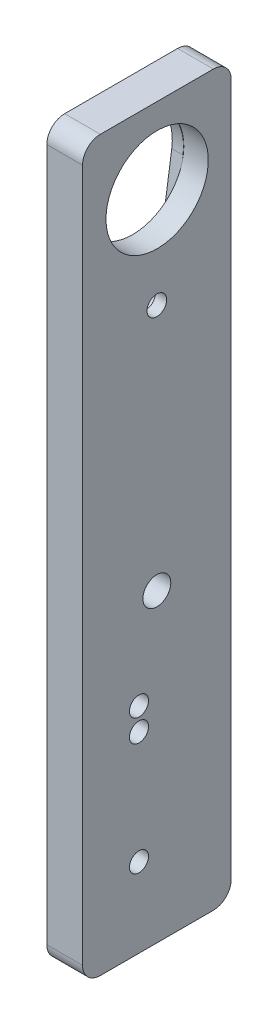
ISO-10303-21;
HEADER;
FILE_DESCRIPTION(('STEP AP214'),'2;1');
FILE_NAME('part.step','',(''),(''),'','','');
FILE_SCHEMA(('AUTOMOTIVE_DESIGN { 1 0 10303 214 1 1 1 1 }'));
ENDSEC;
DATA;
#1=APPLICATION_CONTEXT('core data for automotive mechanical design processes');
#2=APPLICATION_PROTOCOL_DEFINITION('international standard','automotive_design',2000,#1);
#3=PRODUCT_CONTEXT('',#1,'mechanical');
#4=PRODUCT('Part','Part','',(#3));
#5=PRODUCT_RELATED_PRODUCT_CATEGORY('part','',(#4));
#6=PRODUCT_DEFINITION_FORMATION('','',#4);
#7=PRODUCT_DEFINITION_CONTEXT('part definition',#1,'design');
#8=PRODUCT_DEFINITION('design','',#6,#7);
#9=PRODUCT_DEFINITION_SHAPE('','',#8);
#10=(LENGTH_UNIT() NAMED_UNIT(*) SI_UNIT(.MILLI.,.METRE.));
#11=(NAMED_UNIT(*) PLANE_ANGLE_UNIT() SI_UNIT($,.RADIAN.));
#12=(NAMED_UNIT(*) SI_UNIT($,.STERADIAN.) SOLID_ANGLE_UNIT());
#13=UNCERTAINTY_MEASURE_WITH_UNIT(LENGTH_MEASURE(1.E-05),#10,'distance_accuracy_value','');
#14=(GEOMETRIC_REPRESENTATION_CONTEXT(3) GLOBAL_UNCERTAINTY_ASSIGNED_CONTEXT((#13)) GLOBAL_UNIT_ASSIGNED_CONTEXT((#10,
#11,#12)) REPRESENTATION_CONTEXT('',''));
#15=CARTESIAN_POINT('',(0.,0.,0.));
#16=DIRECTION('',(0.,0.,1.));
#17=DIRECTION('',(1.,0.,0.));
#18=AXIS2_PLACEMENT_3D('',#15,#16,#17);
#19=CARTESIAN_POINT('',(-39.6009605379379,30.3127212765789,1.62352832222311));
#20=DIRECTION('',(-1.,0.,0.));
#21=DIRECTION('',(0.,0.,1.));
#22=AXIS2_PLACEMENT_3D('',#19,#20,#21);
#23=CYLINDRICAL_SURFACE('',#22,4.);
#24=CARTESIAN_POINT('',(-43.9509605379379,30.3127212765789,1.62352832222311));
#25=DIRECTION('',(-1.,0.,0.));
#26=DIRECTION('',(0.,0.,1.));
#27=AXIS2_PLACEMENT_3D('',#24,#25,#26);
#28=CIRCLE('',#27,4.);
#29=CARTESIAN_POINT('',(-43.9509605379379,30.3127212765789,5.62352832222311));
#30=VERTEX_POINT('',#29);
#31=EDGE_CURVE('E168',#30,#30,#28,.T.);
#32=ORIENTED_EDGE('',*,*,#31,.T.);
#33=EDGE_LOOP('',(#32));
#34=FACE_BOUND('',#33,.T.);
#35=CARTESIAN_POINT('',(-41.6009605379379,30.3127212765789,1.62352832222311));
#36=DIRECTION('',(1.,0.,0.));
#37=DIRECTION('',(0.,0.,-1.));
#38=AXIS2_PLACEMENT_3D('',#35,#36,#37);
#39=CIRCLE('',#38,4.);
#40=CARTESIAN_POINT('',(-41.6009605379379,30.3127212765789,-2.3764716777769));
#41=VERTEX_POINT('',#40);
#42=EDGE_CURVE('E11',#41,#41,#39,.F.);
#43=ORIENTED_EDGE('',*,*,#42,.F.);
#44=EDGE_LOOP('',(#43));
#45=FACE_BOUND('',#44,.T.);
#46=ADVANCED_FACE('F39',(#34,#45),#23,.F.);
#47=CARTESIAN_POINT('',(-39.6009605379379,-67.9224024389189,4.79852832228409));
#48=DIRECTION('',(0.,-1.,0.));
#49=DIRECTION('',(0.,0.,-1.));
#50=AXIS2_PLACEMENT_3D('',#47,#48,#49);
#51=PLANE('',#50);
#52=DIRECTION('',(0.,0.,1.));
#53=VECTOR('',#52,1.);
#54=CARTESIAN_POINT('',(-45.9509605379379,-67.9224024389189,4.79852832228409));
#55=LINE('',#54,#53);
#56=CARTESIAN_POINT('',(-45.9509605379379,-67.9224024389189,-8.42647167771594));
#57=VERTEX_POINT('',#56);
#58=CARTESIAN_POINT('',(-45.9509605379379,-67.9224024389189,11.6735283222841));
#59=VERTEX_POINT('',#58);
#60=EDGE_CURVE('E178',#57,#59,#55,.T.);
#61=ORIENTED_EDGE('',*,*,#60,.F.);
#62=DIRECTION('',(-1.,0.,0.));
#63=VECTOR('',#62,1.);
#64=CARTESIAN_POINT('',(-39.6009605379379,-67.9224024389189,-8.42647167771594));
#65=LINE('',#64,#63);
#66=CARTESIAN_POINT('',(-39.6009605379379,-67.9224024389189,-8.42647167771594));
#67=VERTEX_POINT('',#66);
#68=EDGE_CURVE('E236',#57,#67,#65,.F.);
#69=ORIENTED_EDGE('',*,*,#68,.T.);
#70=DIRECTION('',(0.,0.,1.));
#71=VECTOR('',#70,1.);
#72=CARTESIAN_POINT('',(-39.6009605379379,-67.9224024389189,4.79852832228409));
#73=LINE('',#72,#71);
#74=CARTESIAN_POINT('',(-39.6009605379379,-67.9224024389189,11.6735283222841));
#75=VERTEX_POINT('',#74);
#76=EDGE_CURVE('E184',#67,#75,#73,.T.);
#77=ORIENTED_EDGE('',*,*,#76,.T.);
#78=DIRECTION('',(-1.,0.,0.));
#79=VECTOR('',#78,1.);
#80=CARTESIAN_POINT('',(-39.6009605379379,-67.9224024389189,11.6735283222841));
#81=LINE('',#80,#79);
#82=EDGE_CURVE('E233',#75,#59,#81,.T.);
#83=ORIENTED_EDGE('',*,*,#82,.T.);
#84=EDGE_LOOP('',(#61,#69,#77,#83));
#85=FACE_BOUND('',#84,.T.);
#86=ADVANCED_FACE('F310',(#85),#51,.T.);
#87=CARTESIAN_POINT('',(-39.6009605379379,28.6275975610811,-11.6014716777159));
#88=DIRECTION('',(0.,0.,-1.));
#89=DIRECTION('',(0.,1.,0.));
#90=AXIS2_PLACEMENT_3D('',#87,#88,#89);
#91=PLANE('',#90);
#92=DIRECTION('',(0.,-1.,0.));
#93=VECTOR('',#92,1.);
#94=CARTESIAN_POINT('',(-45.9509605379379,28.6275975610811,-11.6014716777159));
#95=LINE('',#94,#93);
#96=CARTESIAN_POINT('',(-45.9509605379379,58.5025975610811,-11.6014716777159));
#97=VERTEX_POINT('',#96);
#98=CARTESIAN_POINT('',(-45.9509605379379,-64.7474024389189,-11.6014716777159));
#99=VERTEX_POINT('',#98);
#100=EDGE_CURVE('E199',#97,#99,#95,.T.);
#101=ORIENTED_EDGE('',*,*,#100,.F.);
#102=DIRECTION('',(-1.,0.,0.));
#103=VECTOR('',#102,1.);
#104=CARTESIAN_POINT('',(-39.6009605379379,58.5025975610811,-11.6014716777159));
#105=LINE('',#104,#103);
#106=CARTESIAN_POINT('',(-39.6009605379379,58.5025975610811,-11.6014716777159));
#107=VERTEX_POINT('',#106);
#108=EDGE_CURVE('E222',#97,#107,#105,.F.);
#109=ORIENTED_EDGE('',*,*,#108,.T.);
#110=DIRECTION('',(0.,-1.,0.));
#111=VECTOR('',#110,1.);
#112=CARTESIAN_POINT('',(-39.6009605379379,28.6275975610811,-11.6014716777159));
#113=LINE('',#112,#111);
#114=CARTESIAN_POINT('',(-39.6009605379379,-64.7474024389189,-11.6014716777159));
#115=VERTEX_POINT('',#114);
#116=EDGE_CURVE('E187',#107,#115,#113,.T.);
#117=ORIENTED_EDGE('',*,*,#116,.T.);
#118=DIRECTION('',(-1.,0.,0.));
#119=VECTOR('',#118,1.);
#120=CARTESIAN_POINT('',(-39.6009605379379,-64.7474024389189,-11.6014716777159));
#121=LINE('',#120,#119);
#122=EDGE_CURVE('E219',#115,#99,#121,.T.);
#123=ORIENTED_EDGE('',*,*,#122,.T.);
#124=EDGE_LOOP('',(#101,#109,#117,#123));
#125=FACE_BOUND('',#124,.T.);
#126=ADVANCED_FACE('F316',(#125),#91,.T.);
#127=CARTESIAN_POINT('',(-39.6009605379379,61.6775975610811,4.79852832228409));
#128=DIRECTION('',(0.,1.,0.));
#129=DIRECTION('',(0.,0.,1.));
#130=AXIS2_PLACEMENT_3D('',#127,#128,#129);
#131=PLANE('',#130);
#132=DIRECTION('',(0.,0.,-1.));
#133=VECTOR('',#132,1.);
#134=CARTESIAN_POINT('',(-39.6009605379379,61.6775975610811,4.79852832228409));
#135=LINE('',#134,#133);
#136=CARTESIAN_POINT('',(-39.6009605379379,61.6775975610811,11.6735283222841));
#137=VERTEX_POINT('',#136);
#138=CARTESIAN_POINT('',(-39.6009605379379,61.6775975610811,-8.42647167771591));
#139=VERTEX_POINT('',#138);
#140=EDGE_CURVE('E191',#137,#139,#135,.T.);
#141=ORIENTED_EDGE('',*,*,#140,.T.);
#142=DIRECTION('',(-1.,0.,0.));
#143=VECTOR('',#142,1.);
#144=CARTESIAN_POINT('',(-39.6009605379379,61.6775975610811,-8.42647167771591));
#145=LINE('',#144,#143);
#146=CARTESIAN_POINT('',(-45.9509605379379,61.6775975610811,-8.42647167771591));
#147=VERTEX_POINT('',#146);
#148=EDGE_CURVE('E207',#139,#147,#145,.T.);
#149=ORIENTED_EDGE('',*,*,#148,.T.);
#150=DIRECTION('',(0.,0.,-1.));
#151=VECTOR('',#150,1.);
#152=CARTESIAN_POINT('',(-45.9509605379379,61.6775975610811,4.79852832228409));
#153=LINE('',#152,#151);
#154=CARTESIAN_POINT('',(-45.9509605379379,61.6775975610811,11.6735283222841));
#155=VERTEX_POINT('',#154);
#156=EDGE_CURVE('E202',#155,#147,#153,.T.);
#157=ORIENTED_EDGE('',*,*,#156,.F.);
#158=DIRECTION('',(-1.,0.,0.));
#159=VECTOR('',#158,1.);
#160=CARTESIAN_POINT('',(-39.6009605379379,61.6775975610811,11.6735283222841));
#161=LINE('',#160,#159);
#162=EDGE_CURVE('E196',#155,#137,#161,.F.);
#163=ORIENTED_EDGE('',*,*,#162,.T.);
#164=EDGE_LOOP('',(#141,#149,#157,#163));
#165=FACE_BOUND('',#164,.T.);
#166=ADVANCED_FACE('F304',(#165),#131,.T.);
#167=CARTESIAN_POINT('',(-39.6009605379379,28.6275975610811,14.8485283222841));
#168=DIRECTION('',(0.,0.,1.));
#169=DIRECTION('',(0.,-1.,0.));
#170=AXIS2_PLACEMENT_3D('',#167,#168,#169);
#171=PLANE('',#170);
#172=DIRECTION('',(0.,1.,0.));
#173=VECTOR('',#172,1.);
#174=CARTESIAN_POINT('',(-39.6009605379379,28.6275975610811,14.8485283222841));
#175=LINE('',#174,#173);
#176=CARTESIAN_POINT('',(-39.6009605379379,-64.7474024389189,14.8485283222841));
#177=VERTEX_POINT('',#176);
#178=CARTESIAN_POINT('',(-39.6009605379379,58.5025975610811,14.8485283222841));
#179=VERTEX_POINT('',#178);
#180=EDGE_CURVE('E194',#177,#179,#175,.T.);
#181=ORIENTED_EDGE('',*,*,#180,.T.);
#182=DIRECTION('',(-1.,0.,0.));
#183=VECTOR('',#182,1.);
#184=CARTESIAN_POINT('',(-39.6009605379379,58.5025975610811,14.8485283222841));
#185=LINE('',#184,#183);
#186=CARTESIAN_POINT('',(-45.9509605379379,58.5025975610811,14.8485283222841));
#187=VERTEX_POINT('',#186);
#188=EDGE_CURVE('E137',#179,#187,#185,.T.);
#189=ORIENTED_EDGE('',*,*,#188,.T.);
#190=DIRECTION('',(0.,1.,0.));
#191=VECTOR('',#190,1.);
#192=CARTESIAN_POINT('',(-45.9509605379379,28.6275975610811,14.8485283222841));
#193=LINE('',#192,#191);
#194=CARTESIAN_POINT('',(-45.9509605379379,-64.7474024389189,14.8485283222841));
#195=VERTEX_POINT('',#194);
#196=EDGE_CURVE('E188',#195,#187,#193,.T.);
#197=ORIENTED_EDGE('',*,*,#196,.F.);
#198=DIRECTION('',(-1.,0.,0.));
#199=VECTOR('',#198,1.);
#200=CARTESIAN_POINT('',(-39.6009605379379,-64.7474024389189,14.8485283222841));
#201=LINE('',#200,#199);
#202=EDGE_CURVE('E238',#195,#177,#201,.F.);
#203=ORIENTED_EDGE('',*,*,#202,.T.);
#204=EDGE_LOOP('',(#181,#189,#197,#203));
#205=FACE_BOUND('',#204,.T.);
#206=ADVANCED_FACE('F292',(#205),#171,.T.);
#207=CARTESIAN_POINT('',(-39.6009605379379,28.6275975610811,4.79852832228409));
#208=DIRECTION('',(1.,0.,0.));
#209=DIRECTION('',(0.,0.,-1.));
#210=AXIS2_PLACEMENT_3D('',#207,#208,#209);
#211=PLANE('',#210);
#212=CARTESIAN_POINT('',(-39.6009605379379,-29.8224024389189,4.79852832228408));
#213=DIRECTION('',(-1.,0.,0.));
#214=DIRECTION('',(0.,0.,1.));
#215=AXIS2_PLACEMENT_3D('',#212,#213,#214);
#216=CIRCLE('',#215,1.7);
#217=CARTESIAN_POINT('',(-39.6009605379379,-29.8224024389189,6.49852832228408));
#218=VERTEX_POINT('',#217);
#219=EDGE_CURVE('E255',#218,#218,#216,.T.);
#220=ORIENTED_EDGE('',*,*,#219,.T.);
#221=EDGE_LOOP('',(#220));
#222=FACE_BOUND('',#221,.T.);
#223=CARTESIAN_POINT('',(-39.6009605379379,-33.8224024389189,4.79852832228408));
#224=DIRECTION('',(-1.,0.,0.));
#225=DIRECTION('',(0.,0.,1.));
#226=AXIS2_PLACEMENT_3D('',#223,#224,#225);
#227=CIRCLE('',#226,1.7);
#228=CARTESIAN_POINT('',(-39.6009605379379,-33.8224024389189,6.49852832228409));
#229=VERTEX_POINT('',#228);
#230=EDGE_CURVE('E263',#229,#229,#227,.T.);
#231=ORIENTED_EDGE('',*,*,#230,.T.);
#232=EDGE_LOOP('',(#231));
#233=FACE_BOUND('',#232,.T.);
#234=CARTESIAN_POINT('',(-39.6009605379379,-53.8224024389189,4.79852832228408));
#235=DIRECTION('',(-1.,0.,0.));
#236=DIRECTION('',(0.,0.,1.));
#237=AXIS2_PLACEMENT_3D('',#234,#235,#236);
#238=CIRCLE('',#237,1.7);
#239=CARTESIAN_POINT('',(-39.6009605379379,-53.8224024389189,6.49852832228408));
#240=VERTEX_POINT('',#239);
#241=EDGE_CURVE('E256',#240,#240,#238,.T.);
#242=ORIENTED_EDGE('',*,*,#241,.T.);
#243=EDGE_LOOP('',(#242));
#244=FACE_BOUND('',#243,.T.);
#245=CARTESIAN_POINT('',(-39.6009605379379,-13.6600363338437,1.62352832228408));
#246=DIRECTION('',(1.,0.,0.));
#247=DIRECTION('',(0.,0.,-1.));
#248=AXIS2_PLACEMENT_3D('',#245,#246,#247);
#249=CIRCLE('',#248,2.48125);
#250=CARTESIAN_POINT('',(-39.6009605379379,-13.6600363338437,-0.857721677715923));
#251=VERTEX_POINT('',#250);
#252=EDGE_CURVE('E145',#251,#251,#249,.T.);
#253=ORIENTED_EDGE('',*,*,#252,.F.);
#254=EDGE_LOOP('',(#253));
#255=FACE_BOUND('',#254,.T.);
#256=CARTESIAN_POINT('',(-39.6009605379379,48.096086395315,1.57324528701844));
#257=DIRECTION('',(-1.,0.,0.));
#258=DIRECTION('',(0.,0.,1.));
#259=AXIS2_PLACEMENT_3D('',#256,#257,#258);
#260=CIRCLE('',#259,9.1);
#261=CARTESIAN_POINT('',(-39.6009605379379,48.096086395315,10.6732452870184));
#262=VERTEX_POINT('',#261);
#263=EDGE_CURVE('E144',#262,#262,#260,.T.);
#264=ORIENTED_EDGE('',*,*,#263,.T.);
#265=EDGE_LOOP('',(#264));
#266=FACE_BOUND('',#265,.T.);
#267=ORIENTED_EDGE('',*,*,#180,.F.);
#268=CARTESIAN_POINT('',(-39.6009605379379,-64.7474024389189,11.6735283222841));
#269=DIRECTION('',(1.,0.,0.));
#270=DIRECTION('',(0.,0.,-1.));
#271=AXIS2_PLACEMENT_3D('',#268,#269,#270);
#272=CIRCLE('',#271,3.175);
#273=EDGE_CURVE('E227',#177,#75,#272,.T.);
#274=ORIENTED_EDGE('',*,*,#273,.T.);
#275=ORIENTED_EDGE('',*,*,#76,.F.);
#276=CARTESIAN_POINT('',(-39.6009605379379,-64.7474024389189,-8.42647167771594));
#277=DIRECTION('',(1.,0.,0.));
#278=DIRECTION('',(0.,0.,-1.));
#279=AXIS2_PLACEMENT_3D('',#276,#277,#278);
#280=CIRCLE('',#279,3.175);
#281=EDGE_CURVE('E229',#67,#115,#280,.T.);
#282=ORIENTED_EDGE('',*,*,#281,.T.);
#283=ORIENTED_EDGE('',*,*,#116,.F.);
#284=CARTESIAN_POINT('',(-39.6009605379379,58.5025975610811,-8.42647167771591));
#285=DIRECTION('',(1.,0.,0.));
#286=DIRECTION('',(0.,0.,-1.));
#287=AXIS2_PLACEMENT_3D('',#284,#285,#286);
#288=CIRCLE('',#287,3.175);
#289=EDGE_CURVE('E231',#107,#139,#288,.T.);
#290=ORIENTED_EDGE('',*,*,#289,.T.);
#291=ORIENTED_EDGE('',*,*,#140,.F.);
#292=CARTESIAN_POINT('',(-39.6009605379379,58.5025975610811,11.6735283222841));
#293=DIRECTION('',(1.,0.,0.));
#294=DIRECTION('',(0.,0.,-1.));
#295=AXIS2_PLACEMENT_3D('',#292,#293,#294);
#296=CIRCLE('',#295,3.175);
#297=EDGE_CURVE('E224',#137,#179,#296,.T.);
#298=ORIENTED_EDGE('',*,*,#297,.T.);
#299=EDGE_LOOP('',(#267,#274,#275,#282,#283,#290,#291,#298));
#300=FACE_BOUND('',#299,.T.);
#301=CARTESIAN_POINT('',(-39.6009605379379,30.3127212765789,1.62352832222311));
#302=DIRECTION('',(1.,0.,0.));
#303=DIRECTION('',(0.,0.,-1.));
#304=AXIS2_PLACEMENT_3D('',#301,#302,#303);
#305=CIRCLE('',#304,1.75);
#306=CARTESIAN_POINT('',(-39.6009605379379,30.3127212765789,-0.126471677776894));
#307=VERTEX_POINT('',#306);
#308=EDGE_CURVE('E274',#307,#307,#305,.T.);
#309=ORIENTED_EDGE('',*,*,#308,.F.);
#310=EDGE_LOOP('',(#309));
#311=FACE_BOUND('',#310,.T.);
#312=ADVANCED_FACE('F289',(#222,#233,#244,#255,#266,#300,#311),#211,.T.);
#313=CARTESIAN_POINT('',(-45.9509605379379,28.6275975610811,4.79852832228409));
#314=DIRECTION('',(1.,0.,0.));
#315=DIRECTION('',(0.,0.,-1.));
#316=AXIS2_PLACEMENT_3D('',#313,#314,#315);
#317=PLANE('',#316);
#318=CARTESIAN_POINT('',(-45.9509605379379,-29.8224024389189,4.79852832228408));
#319=DIRECTION('',(-1.,0.,0.));
#320=DIRECTION('',(0.,0.,1.));
#321=AXIS2_PLACEMENT_3D('',#318,#319,#320);
#322=CIRCLE('',#321,1.7);
#323=CARTESIAN_POINT('',(-45.9509605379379,-29.8224024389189,6.49852832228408));
#324=VERTEX_POINT('',#323);
#325=EDGE_CURVE('E269',#324,#324,#322,.T.);
#326=ORIENTED_EDGE('',*,*,#325,.F.);
#327=EDGE_LOOP('',(#326));
#328=FACE_BOUND('',#327,.T.);
#329=CARTESIAN_POINT('',(-45.9509605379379,-33.8224024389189,4.79852832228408));
#330=DIRECTION('',(-1.,0.,0.));
#331=DIRECTION('',(0.,0.,1.));
#332=AXIS2_PLACEMENT_3D('',#329,#330,#331);
#333=CIRCLE('',#332,1.7);
#334=CARTESIAN_POINT('',(-45.9509605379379,-33.8224024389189,6.49852832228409));
#335=VERTEX_POINT('',#334);
#336=EDGE_CURVE('E266',#335,#335,#333,.T.);
#337=ORIENTED_EDGE('',*,*,#336,.F.);
#338=EDGE_LOOP('',(#337));
#339=FACE_BOUND('',#338,.T.);
#340=CARTESIAN_POINT('',(-45.9509605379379,-53.8224024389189,4.79852832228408));
#341=DIRECTION('',(-1.,0.,0.));
#342=DIRECTION('',(0.,0.,1.));
#343=AXIS2_PLACEMENT_3D('',#340,#341,#342);
#344=CIRCLE('',#343,1.7);
#345=CARTESIAN_POINT('',(-45.9509605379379,-53.8224024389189,6.49852832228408));
#346=VERTEX_POINT('',#345);
#347=EDGE_CURVE('E259',#346,#346,#344,.T.);
#348=ORIENTED_EDGE('',*,*,#347,.F.);
#349=EDGE_LOOP('',(#348));
#350=FACE_BOUND('',#349,.T.);
#351=CARTESIAN_POINT('',(-45.9509605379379,-13.6600363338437,1.62352832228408));
#352=DIRECTION('',(-1.,0.,0.));
#353=DIRECTION('',(0.,0.,1.));
#354=AXIS2_PLACEMENT_3D('',#351,#352,#353);
#355=CIRCLE('',#354,2.48125);
#356=CARTESIAN_POINT('',(-45.9509605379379,-13.6600363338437,4.10477832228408));
#357=VERTEX_POINT('',#356);
#358=EDGE_CURVE('E252',#357,#357,#355,.T.);
#359=ORIENTED_EDGE('',*,*,#358,.F.);
#360=EDGE_LOOP('',(#359));
#361=FACE_BOUND('',#360,.T.);
#362=DIRECTION('',(0.,-0.989326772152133,0.145713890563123));
#363=VECTOR('',#362,1.);
#364=CARTESIAN_POINT('',(-45.9509605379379,46.7667248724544,-7.37934530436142));
#365=LINE('',#364,#363);
#366=CARTESIAN_POINT('',(-45.9509605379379,46.7667248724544,-7.37934530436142));
#367=VERTEX_POINT('',#366);
#368=CARTESIAN_POINT('',(-45.9509605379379,25.1097350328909,-4.18957592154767));
#369=VERTEX_POINT('',#368);
#370=EDGE_CURVE('E167',#367,#369,#365,.T.);
#371=ORIENTED_EDGE('',*,*,#370,.F.);
#372=CARTESIAN_POINT('',(-45.9509605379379,48.0927212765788,1.62352832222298));
#373=DIRECTION('',(-1.,0.,0.));
#374=DIRECTION('',(0.,0.,1.));
#375=AXIS2_PLACEMENT_3D('',#372,#373,#374);
#376=CIRCLE('',#375,9.1);
#377=CARTESIAN_POINT('',(-45.9509605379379,46.7667248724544,10.6264019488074));
#378=VERTEX_POINT('',#377);
#379=EDGE_CURVE('E61',#378,#367,#376,.T.);
#380=ORIENTED_EDGE('',*,*,#379,.F.);
#381=DIRECTION('',(0.,0.989326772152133,0.145713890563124));
#382=VECTOR('',#381,1.);
#383=CARTESIAN_POINT('',(-45.9509605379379,46.7667248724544,10.6264019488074));
#384=LINE('',#383,#382);
#385=CARTESIAN_POINT('',(-45.9509605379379,25.1097350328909,7.43663256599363));
#386=VERTEX_POINT('',#385);
#387=EDGE_CURVE('E152',#386,#378,#384,.T.);
#388=ORIENTED_EDGE('',*,*,#387,.F.);
#389=DIRECTION('',(0.,0.,1.));
#390=VECTOR('',#389,1.);
#391=CARTESIAN_POINT('',(-45.9509605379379,25.1097350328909,-4.18957592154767));
#392=LINE('',#391,#390);
#393=EDGE_CURVE('E171',#369,#386,#392,.T.);
#394=ORIENTED_EDGE('',*,*,#393,.F.);
#395=EDGE_LOOP('',(#371,#380,#388,#394));
#396=FACE_BOUND('',#395,.T.);
#397=CARTESIAN_POINT('',(-45.9509605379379,-64.7474024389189,11.6735283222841));
#398=DIRECTION('',(1.,0.,0.));
#399=DIRECTION('',(0.,0.,-1.));
#400=AXIS2_PLACEMENT_3D('',#397,#398,#399);
#401=CIRCLE('',#400,3.175);
#402=EDGE_CURVE('E212',#59,#195,#401,.F.);
#403=ORIENTED_EDGE('',*,*,#402,.T.);
#404=ORIENTED_EDGE('',*,*,#196,.T.);
#405=CARTESIAN_POINT('',(-45.9509605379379,58.5025975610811,11.6735283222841));
#406=DIRECTION('',(1.,0.,0.));
#407=DIRECTION('',(0.,0.,-1.));
#408=AXIS2_PLACEMENT_3D('',#405,#406,#407);
#409=CIRCLE('',#408,3.175);
#410=EDGE_CURVE('E210',#187,#155,#409,.F.);
#411=ORIENTED_EDGE('',*,*,#410,.T.);
#412=ORIENTED_EDGE('',*,*,#156,.T.);
#413=CARTESIAN_POINT('',(-45.9509605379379,58.5025975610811,-8.42647167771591));
#414=DIRECTION('',(1.,0.,0.));
#415=DIRECTION('',(0.,0.,-1.));
#416=AXIS2_PLACEMENT_3D('',#413,#414,#415);
#417=CIRCLE('',#416,3.175);
#418=EDGE_CURVE('E217',#147,#97,#417,.F.);
#419=ORIENTED_EDGE('',*,*,#418,.T.);
#420=ORIENTED_EDGE('',*,*,#100,.T.);
#421=CARTESIAN_POINT('',(-45.9509605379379,-64.7474024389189,-8.42647167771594));
#422=DIRECTION('',(1.,0.,0.));
#423=DIRECTION('',(0.,0.,-1.));
#424=AXIS2_PLACEMENT_3D('',#421,#422,#423);
#425=CIRCLE('',#424,3.175);
#426=EDGE_CURVE('E215',#99,#57,#425,.F.);
#427=ORIENTED_EDGE('',*,*,#426,.T.);
#428=ORIENTED_EDGE('',*,*,#60,.T.);
#429=EDGE_LOOP('',(#403,#404,#411,#412,#419,#420,#427,#428));
#430=FACE_BOUND('',#429,.T.);
#431=ADVANCED_FACE('F291',(#328,#339,#350,#361,#396,#430),#317,.F.);
#432=CARTESIAN_POINT('',(-39.6009605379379,58.5025975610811,-8.42647167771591));
#433=DIRECTION('',(-1.,0.,0.));
#434=DIRECTION('',(0.,0.,1.));
#435=AXIS2_PLACEMENT_3D('',#432,#433,#434);
#436=CYLINDRICAL_SURFACE('',#435,3.175);
#437=ORIENTED_EDGE('',*,*,#289,.F.);
#438=ORIENTED_EDGE('',*,*,#108,.F.);
#439=ORIENTED_EDGE('',*,*,#418,.F.);
#440=ORIENTED_EDGE('',*,*,#148,.F.);
#441=EDGE_LOOP('',(#437,#438,#439,#440));
#442=FACE_BOUND('',#441,.T.);
#443=ADVANCED_FACE('F300',(#442),#436,.T.);
#444=CARTESIAN_POINT('',(-39.6009605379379,-64.7474024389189,-8.42647167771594));
#445=DIRECTION('',(-1.,0.,0.));
#446=DIRECTION('',(0.,0.,1.));
#447=AXIS2_PLACEMENT_3D('',#444,#445,#446);
#448=CYLINDRICAL_SURFACE('',#447,3.175);
#449=ORIENTED_EDGE('',*,*,#281,.F.);
#450=ORIENTED_EDGE('',*,*,#68,.F.);
#451=ORIENTED_EDGE('',*,*,#426,.F.);
#452=ORIENTED_EDGE('',*,*,#122,.F.);
#453=EDGE_LOOP('',(#449,#450,#451,#452));
#454=FACE_BOUND('',#453,.T.);
#455=ADVANCED_FACE('F345',(#454),#448,.T.);
#456=CARTESIAN_POINT('',(-39.6009605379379,-64.7474024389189,11.6735283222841));
#457=DIRECTION('',(-1.,0.,0.));
#458=DIRECTION('',(0.,0.,1.));
#459=AXIS2_PLACEMENT_3D('',#456,#457,#458);
#460=CYLINDRICAL_SURFACE('',#459,3.175);
#461=ORIENTED_EDGE('',*,*,#273,.F.);
#462=ORIENTED_EDGE('',*,*,#202,.F.);
#463=ORIENTED_EDGE('',*,*,#402,.F.);
#464=ORIENTED_EDGE('',*,*,#82,.F.);
#465=EDGE_LOOP('',(#461,#462,#463,#464));
#466=FACE_BOUND('',#465,.T.);
#467=ADVANCED_FACE('F340',(#466),#460,.T.);
#468=CARTESIAN_POINT('',(-39.6009605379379,58.5025975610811,11.6735283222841));
#469=DIRECTION('',(-1.,0.,0.));
#470=DIRECTION('',(0.,0.,1.));
#471=AXIS2_PLACEMENT_3D('',#468,#469,#470);
#472=CYLINDRICAL_SURFACE('',#471,3.175);
#473=ORIENTED_EDGE('',*,*,#297,.F.);
#474=ORIENTED_EDGE('',*,*,#162,.F.);
#475=ORIENTED_EDGE('',*,*,#410,.F.);
#476=ORIENTED_EDGE('',*,*,#188,.F.);
#477=EDGE_LOOP('',(#473,#474,#475,#476));
#478=FACE_BOUND('',#477,.T.);
#479=ADVANCED_FACE('F41',(#478),#472,.T.);
#480=CARTESIAN_POINT('',(-43.9509605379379,48.0927212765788,1.62352832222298));
#481=DIRECTION('',(-1.,0.,0.));
#482=DIRECTION('',(0.,0.,1.));
#483=AXIS2_PLACEMENT_3D('',#480,#481,#482);
#484=CYLINDRICAL_SURFACE('',#483,9.1);
#485=ORIENTED_EDGE('',*,*,#379,.T.);
#486=DIRECTION('',(-1.,0.,0.));
#487=VECTOR('',#486,1.);
#488=CARTESIAN_POINT('',(-43.9509605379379,46.7667248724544,-7.37934530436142));
#489=LINE('',#488,#487);
#490=CARTESIAN_POINT('',(-43.9509605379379,46.7667248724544,-7.37934530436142));
#491=VERTEX_POINT('',#490);
#492=EDGE_CURVE('E151',#491,#367,#489,.T.);
#493=ORIENTED_EDGE('',*,*,#492,.F.);
#494=CARTESIAN_POINT('',(-43.9509605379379,48.0927212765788,1.62352832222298));
#495=DIRECTION('',(-1.,0.,0.));
#496=DIRECTION('',(0.,0.,1.));
#497=AXIS2_PLACEMENT_3D('',#494,#495,#496);
#498=CIRCLE('',#497,9.1);
#499=CARTESIAN_POINT('',(-43.9509605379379,57.1740588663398,2.20602946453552));
#500=VERTEX_POINT('',#499);
#501=EDGE_CURVE('E141',#500,#491,#498,.T.);
#502=ORIENTED_EDGE('',*,*,#501,.F.);
#503=CARTESIAN_POINT('',(-43.9509605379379,46.7667248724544,10.6264019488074));
#504=VERTEX_POINT('',#503);
#505=EDGE_CURVE('E149',#504,#500,#498,.T.);
#506=ORIENTED_EDGE('',*,*,#505,.F.);
#507=DIRECTION('',(-1.,0.,0.));
#508=VECTOR('',#507,1.);
#509=CARTESIAN_POINT('',(-43.9509605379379,46.7667248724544,10.6264019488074));
#510=LINE('',#509,#508);
#511=EDGE_CURVE('E176',#504,#378,#510,.T.);
#512=ORIENTED_EDGE('',*,*,#511,.T.);
#513=EDGE_LOOP('',(#485,#493,#502,#506,#512));
#514=FACE_BOUND('',#513,.T.);
#515=ADVANCED_FACE('F148',(#514),#484,.F.);
#516=CARTESIAN_POINT('',(-43.9509605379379,46.7667248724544,10.6264019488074));
#517=DIRECTION('',(0.,-0.145713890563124,0.989326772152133));
#518=DIRECTION('',(0.,-0.989326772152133,-0.145713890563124));
#519=AXIS2_PLACEMENT_3D('',#516,#517,#518);
#520=PLANE('',#519);
#521=ORIENTED_EDGE('',*,*,#387,.T.);
#522=ORIENTED_EDGE('',*,*,#511,.F.);
#523=DIRECTION('',(0.,0.989326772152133,0.145713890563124));
#524=VECTOR('',#523,1.);
#525=CARTESIAN_POINT('',(-43.9509605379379,46.7667248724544,10.6264019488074));
#526=LINE('',#525,#524);
#527=CARTESIAN_POINT('',(-43.9509605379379,25.1097350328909,7.43663256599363));
#528=VERTEX_POINT('',#527);
#529=EDGE_CURVE('E158',#528,#504,#526,.T.);
#530=ORIENTED_EDGE('',*,*,#529,.F.);
#531=DIRECTION('',(-1.,0.,0.));
#532=VECTOR('',#531,1.);
#533=CARTESIAN_POINT('',(-43.9509605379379,25.1097350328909,7.43663256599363));
#534=LINE('',#533,#532);
#535=EDGE_CURVE('E179',#528,#386,#534,.T.);
#536=ORIENTED_EDGE('',*,*,#535,.T.);
#537=EDGE_LOOP('',(#521,#522,#530,#536));
#538=FACE_BOUND('',#537,.T.);
#539=ADVANCED_FACE('F326',(#538),#520,.F.);
#540=CARTESIAN_POINT('',(-43.9509605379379,25.1097350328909,-4.18957592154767));
#541=DIRECTION('',(0.,-1.,0.));
#542=DIRECTION('',(0.,0.,-1.));
#543=AXIS2_PLACEMENT_3D('',#540,#541,#542);
#544=PLANE('',#543);
#545=ORIENTED_EDGE('',*,*,#393,.T.);
#546=ORIENTED_EDGE('',*,*,#535,.F.);
#547=DIRECTION('',(0.,0.,1.));
#548=VECTOR('',#547,1.);
#549=CARTESIAN_POINT('',(-43.9509605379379,25.1097350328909,-4.18957592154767));
#550=LINE('',#549,#548);
#551=CARTESIAN_POINT('',(-43.9509605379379,25.1097350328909,-4.18957592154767));
#552=VERTEX_POINT('',#551);
#553=EDGE_CURVE('E163',#552,#528,#550,.T.);
#554=ORIENTED_EDGE('',*,*,#553,.F.);
#555=DIRECTION('',(-1.,0.,0.));
#556=VECTOR('',#555,1.);
#557=CARTESIAN_POINT('',(-43.9509605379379,25.1097350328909,-4.18957592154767));
#558=LINE('',#557,#556);
#559=EDGE_CURVE('E181',#552,#369,#558,.T.);
#560=ORIENTED_EDGE('',*,*,#559,.T.);
#561=EDGE_LOOP('',(#545,#546,#554,#560));
#562=FACE_BOUND('',#561,.T.);
#563=ADVANCED_FACE('F329',(#562),#544,.F.);
#564=CARTESIAN_POINT('',(-43.9509605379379,46.7667248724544,-7.37934530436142));
#565=DIRECTION('',(0.,-0.145713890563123,-0.989326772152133));
#566=DIRECTION('',(0.,0.989326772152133,-0.145713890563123));
#567=AXIS2_PLACEMENT_3D('',#564,#565,#566);
#568=PLANE('',#567);
#569=ORIENTED_EDGE('',*,*,#370,.T.);
#570=ORIENTED_EDGE('',*,*,#559,.F.);
#571=DIRECTION('',(0.,-0.989326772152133,0.145713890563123));
#572=VECTOR('',#571,1.);
#573=CARTESIAN_POINT('',(-43.9509605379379,46.7667248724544,-7.37934530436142));
#574=LINE('',#573,#572);
#575=CARTESIAN_POINT('',(-43.9509605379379,45.8418258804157,-7.24312071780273));
#576=VERTEX_POINT('',#575);
#577=EDGE_CURVE('E159',#576,#552,#574,.T.);
#578=ORIENTED_EDGE('',*,*,#577,.F.);
#579=EDGE_CURVE('E143',#491,#576,#574,.T.);
#580=ORIENTED_EDGE('',*,*,#579,.F.);
#581=ORIENTED_EDGE('',*,*,#492,.T.);
#582=EDGE_LOOP('',(#569,#570,#578,#580,#581));
#583=FACE_BOUND('',#582,.T.);
#584=ADVANCED_FACE('F325',(#583),#568,.F.);
#585=CARTESIAN_POINT('',(-43.9509605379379,48.0927212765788,1.62352832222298));
#586=DIRECTION('',(-1.,0.,0.));
#587=DIRECTION('',(0.,0.,1.));
#588=AXIS2_PLACEMENT_3D('',#585,#586,#587);
#589=PLANE('',#588);
#590=CARTESIAN_POINT('',(-43.9509605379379,48.096086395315,1.57324528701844));
#591=DIRECTION('',(-1.,0.,0.));
#592=DIRECTION('',(0.,0.,1.));
#593=AXIS2_PLACEMENT_3D('',#590,#591,#592);
#594=CIRCLE('',#593,9.1);
#595=EDGE_CURVE('E47',#576,#500,#594,.T.);
#596=ORIENTED_EDGE('',*,*,#595,.F.);
#597=ORIENTED_EDGE('',*,*,#577,.T.);
#598=ORIENTED_EDGE('',*,*,#553,.T.);
#599=ORIENTED_EDGE('',*,*,#529,.T.);
#600=ORIENTED_EDGE('',*,*,#505,.T.);
#601=EDGE_LOOP('',(#596,#597,#598,#599,#600));
#602=FACE_BOUND('',#601,.T.);
#603=ORIENTED_EDGE('',*,*,#31,.F.);
#604=EDGE_LOOP('',(#603));
#605=FACE_BOUND('',#604,.T.);
#606=ADVANCED_FACE('F154',(#602,#605),#589,.T.);
#607=CARTESIAN_POINT('',(-43.9509605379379,48.096086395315,1.57324528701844));
#608=DIRECTION('',(-1.,0.,0.));
#609=DIRECTION('',(0.,0.,1.));
#610=AXIS2_PLACEMENT_3D('',#607,#608,#609);
#611=PLANE('',#610);
#612=ORIENTED_EDGE('',*,*,#579,.T.);
#613=CARTESIAN_POINT('',(-43.9509605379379,48.096086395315,1.57324528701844));
#614=DIRECTION('',(-1.,0.,0.));
#615=DIRECTION('',(0.,0.,1.));
#616=AXIS2_PLACEMENT_3D('',#613,#614,#615);
#617=CIRCLE('',#616,9.1);
#618=EDGE_CURVE('E53',#500,#576,#617,.T.);
#619=ORIENTED_EDGE('',*,*,#618,.F.);
#620=ORIENTED_EDGE('',*,*,#501,.T.);
#621=EDGE_LOOP('',(#612,#619,#620));
#622=FACE_BOUND('',#621,.T.);
#623=ADVANCED_FACE('F140',(#622),#611,.F.);
#624=CARTESIAN_POINT('',(-39.6009605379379,48.096086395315,1.57324528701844));
#625=DIRECTION('',(-1.,0.,0.));
#626=DIRECTION('',(0.,0.,1.));
#627=AXIS2_PLACEMENT_3D('',#624,#625,#626);
#628=CYLINDRICAL_SURFACE('',#627,9.1);
#629=ORIENTED_EDGE('',*,*,#263,.F.);
#630=EDGE_LOOP('',(#629));
#631=FACE_BOUND('',#630,.T.);
#632=ORIENTED_EDGE('',*,*,#618,.T.);
#633=ORIENTED_EDGE('',*,*,#595,.T.);
#634=EDGE_LOOP('',(#632,#633));
#635=FACE_BOUND('',#634,.T.);
#636=ADVANCED_FACE('F133',(#631,#635),#628,.F.);
#637=CARTESIAN_POINT('',(-35.9509605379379,-13.6600363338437,1.62352832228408));
#638=DIRECTION('',(-1.,0.,0.));
#639=DIRECTION('',(0.,0.,1.));
#640=AXIS2_PLACEMENT_3D('',#637,#638,#639);
#641=CYLINDRICAL_SURFACE('',#640,2.48125);
#642=ORIENTED_EDGE('',*,*,#252,.T.);
#643=EDGE_LOOP('',(#642));
#644=FACE_BOUND('',#643,.T.);
#645=ORIENTED_EDGE('',*,*,#358,.T.);
#646=EDGE_LOOP('',(#645));
#647=FACE_BOUND('',#646,.T.);
#648=ADVANCED_FACE('F479',(#644,#647),#641,.F.);
#649=CARTESIAN_POINT('',(-39.6009605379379,-53.8224024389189,4.79852832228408));
#650=DIRECTION('',(-1.,0.,0.));
#651=DIRECTION('',(0.,0.,1.));
#652=AXIS2_PLACEMENT_3D('',#649,#650,#651);
#653=CYLINDRICAL_SURFACE('',#652,1.7);
#654=ORIENTED_EDGE('',*,*,#241,.F.);
#655=EDGE_LOOP('',(#654));
#656=FACE_BOUND('',#655,.T.);
#657=ORIENTED_EDGE('',*,*,#347,.T.);
#658=EDGE_LOOP('',(#657));
#659=FACE_BOUND('',#658,.T.);
#660=ADVANCED_FACE('F488',(#656,#659),#653,.F.);
#661=CARTESIAN_POINT('',(-39.6009605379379,-33.8224024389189,4.79852832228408));
#662=DIRECTION('',(-1.,0.,0.));
#663=DIRECTION('',(0.,0.,1.));
#664=AXIS2_PLACEMENT_3D('',#661,#662,#663);
#665=CYLINDRICAL_SURFACE('',#664,1.7);
#666=ORIENTED_EDGE('',*,*,#230,.F.);
#667=EDGE_LOOP('',(#666));
#668=FACE_BOUND('',#667,.T.);
#669=ORIENTED_EDGE('',*,*,#336,.T.);
#670=EDGE_LOOP('',(#669));
#671=FACE_BOUND('',#670,.T.);
#672=ADVANCED_FACE('F498',(#668,#671),#665,.F.);
#673=CARTESIAN_POINT('',(-39.6009605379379,-29.8224024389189,4.79852832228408));
#674=DIRECTION('',(-1.,0.,0.));
#675=DIRECTION('',(0.,0.,1.));
#676=AXIS2_PLACEMENT_3D('',#673,#674,#675);
#677=CYLINDRICAL_SURFACE('',#676,1.7);
#678=ORIENTED_EDGE('',*,*,#219,.F.);
#679=EDGE_LOOP('',(#678));
#680=FACE_BOUND('',#679,.T.);
#681=ORIENTED_EDGE('',*,*,#325,.T.);
#682=EDGE_LOOP('',(#681));
#683=FACE_BOUND('',#682,.T.);
#684=ADVANCED_FACE('F509',(#680,#683),#677,.F.);
#685=CARTESIAN_POINT('',(-41.6009605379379,30.3127212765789,1.62352832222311));
#686=DIRECTION('',(1.,0.,0.));
#687=DIRECTION('',(0.,0.,-1.));
#688=AXIS2_PLACEMENT_3D('',#685,#686,#687);
#689=PLANE('',#688);
#690=CARTESIAN_POINT('',(-41.6009605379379,30.3127212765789,1.62352832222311));
#691=DIRECTION('',(1.,0.,0.));
#692=DIRECTION('',(0.,0.,-1.));
#693=AXIS2_PLACEMENT_3D('',#690,#691,#692);
#694=CIRCLE('',#693,1.75);
#695=CARTESIAN_POINT('',(-41.6009605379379,30.3127212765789,-0.126471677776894));
#696=VERTEX_POINT('',#695);
#697=EDGE_CURVE('E260',#696,#696,#694,.T.);
#698=ORIENTED_EDGE('',*,*,#697,.T.);
#699=EDGE_LOOP('',(#698));
#700=FACE_BOUND('',#699,.T.);
#701=ORIENTED_EDGE('',*,*,#42,.T.);
#702=EDGE_LOOP('',(#701));
#703=FACE_BOUND('',#702,.T.);
#704=ADVANCED_FACE('F280',(#700,#703),#689,.F.);
#705=CARTESIAN_POINT('',(-41.6009605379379,30.3127212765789,1.62352832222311));
#706=DIRECTION('',(1.,0.,0.));
#707=DIRECTION('',(0.,0.,-1.));
#708=AXIS2_PLACEMENT_3D('',#705,#706,#707);
#709=CYLINDRICAL_SURFACE('',#708,1.75);
#710=ORIENTED_EDGE('',*,*,#697,.F.);
#711=EDGE_LOOP('',(#710));
#712=FACE_BOUND('',#711,.T.);
#713=ORIENTED_EDGE('',*,*,#308,.T.);
#714=EDGE_LOOP('',(#713));
#715=FACE_BOUND('',#714,.T.);
#716=ADVANCED_FACE('F283',(#712,#715),#709,.F.);
#717=CLOSED_SHELL('',(#46,#86,#126,#166,#206,#312,#431,#443,#455,#467,#479,#515,#539,#563,#584,
#606,#623,#636,#648,#660,#672,#684,#704,#716));
#718=MANIFOLD_SOLID_BREP('B2',#717);
#719=ADVANCED_BREP_SHAPE_REPRESENTATION('',(#18,#718),#14);
#720=SHAPE_DEFINITION_REPRESENTATION(#9,#719);
ENDSEC;
END-ISO-10303-21;
